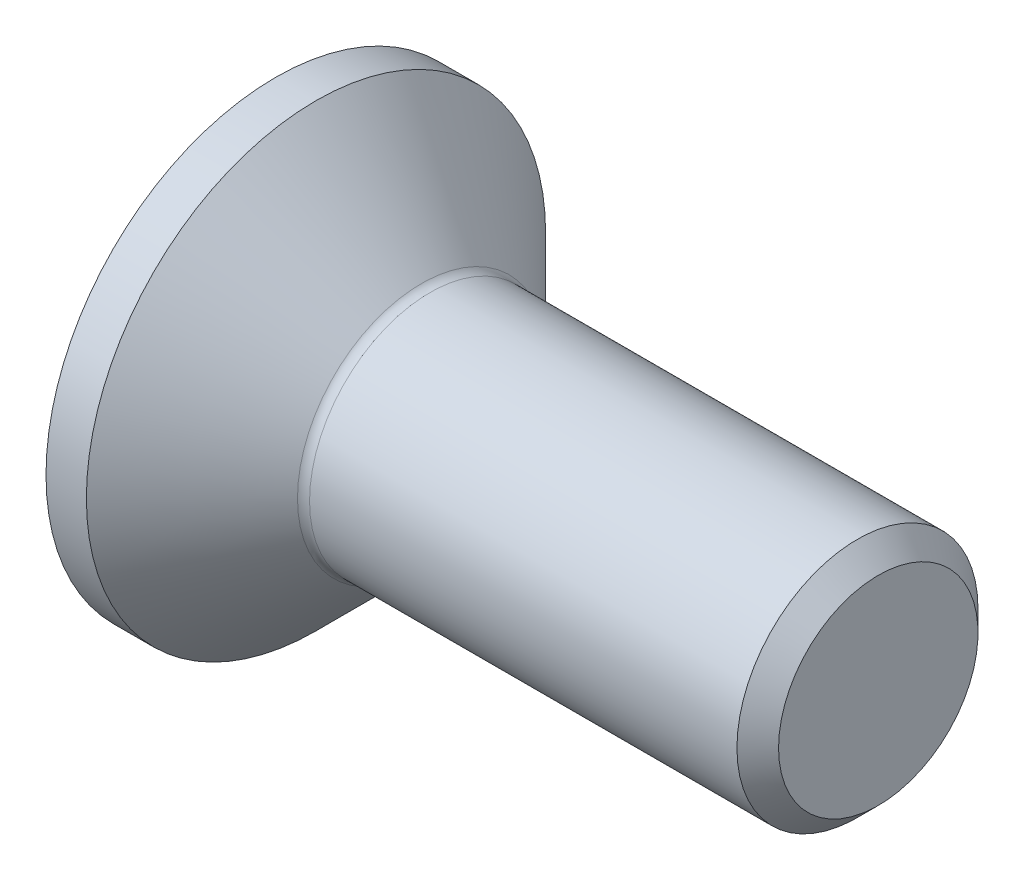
ISO-10303-21;
HEADER;
FILE_DESCRIPTION(('STEP AP214'),'2;1');
FILE_NAME('part.step','',(''),(''),'','','');
FILE_SCHEMA(('AUTOMOTIVE_DESIGN { 1 0 10303 214 1 1 1 1 }'));
ENDSEC;
DATA;
#1=APPLICATION_CONTEXT('core data for automotive mechanical design processes');
#2=APPLICATION_PROTOCOL_DEFINITION('international standard','automotive_design',2000,#1);
#3=PRODUCT_CONTEXT('',#1,'mechanical');
#4=PRODUCT('Part','Part','',(#3));
#5=PRODUCT_RELATED_PRODUCT_CATEGORY('part','',(#4));
#6=PRODUCT_DEFINITION_FORMATION('','',#4);
#7=PRODUCT_DEFINITION_CONTEXT('part definition',#1,'design');
#8=PRODUCT_DEFINITION('design','',#6,#7);
#9=PRODUCT_DEFINITION_SHAPE('','',#8);
#10=(LENGTH_UNIT() NAMED_UNIT(*) SI_UNIT(.MILLI.,.METRE.));
#11=(NAMED_UNIT(*) PLANE_ANGLE_UNIT() SI_UNIT($,.RADIAN.));
#12=(NAMED_UNIT(*) SI_UNIT($,.STERADIAN.) SOLID_ANGLE_UNIT());
#13=UNCERTAINTY_MEASURE_WITH_UNIT(LENGTH_MEASURE(1.E-05),#10,'distance_accuracy_value','');
#14=(GEOMETRIC_REPRESENTATION_CONTEXT(3) GLOBAL_UNCERTAINTY_ASSIGNED_CONTEXT((#13)) GLOBAL_UNIT_ASSIGNED_CONTEXT((#10,
#11,#12)) REPRESENTATION_CONTEXT('',''));
#15=CARTESIAN_POINT('',(0.,0.,0.));
#16=DIRECTION('',(0.,0.,1.));
#17=DIRECTION('',(1.,0.,0.));
#18=AXIS2_PLACEMENT_3D('',#15,#16,#17);
#19=CARTESIAN_POINT('',(0.,0.,0.));
#20=DIRECTION('',(-1.,0.,0.));
#21=DIRECTION('',(0.,0.,1.));
#22=AXIS2_PLACEMENT_3D('',#19,#20,#21);
#23=PLANE('',#22);
#24=CARTESIAN_POINT('',(0.,0.,0.));
#25=DIRECTION('',(-1.,0.,0.));
#26=DIRECTION('',(0.,0.,1.));
#27=AXIS2_PLACEMENT_3D('',#24,#25,#26);
#28=CIRCLE('',#27,7.62);
#29=CARTESIAN_POINT('',(0.,0.,7.62));
#30=VERTEX_POINT('',#29);
#31=EDGE_CURVE('E155',#30,#30,#28,.T.);
#32=ORIENTED_EDGE('',*,*,#31,.T.);
#33=EDGE_LOOP('',(#32));
#34=FACE_BOUND('',#33,.T.);
#35=DIRECTION('',(0.,-0.5,-0.866025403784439));
#36=VECTOR('',#35,1.);
#37=CARTESIAN_POINT('',(0.,-1.44337567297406,2.5));
#38=LINE('',#37,#36);
#39=CARTESIAN_POINT('',(0.,-1.44337567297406,2.5));
#40=VERTEX_POINT('',#39);
#41=CARTESIAN_POINT('',(0.,-2.88675134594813,0.));
#42=VERTEX_POINT('',#41);
#43=EDGE_CURVE('E117',#40,#42,#38,.T.);
#44=ORIENTED_EDGE('',*,*,#43,.T.);
#45=DIRECTION('',(0.,0.5,-0.866025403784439));
#46=VECTOR('',#45,1.);
#47=CARTESIAN_POINT('',(0.,-2.88675134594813,0.));
#48=LINE('',#47,#46);
#49=CARTESIAN_POINT('',(0.,-1.44337567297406,-2.5));
#50=VERTEX_POINT('',#49);
#51=EDGE_CURVE('E47',#42,#50,#48,.T.);
#52=ORIENTED_EDGE('',*,*,#51,.T.);
#53=DIRECTION('',(0.,1.,0.));
#54=VECTOR('',#53,1.);
#55=CARTESIAN_POINT('',(0.,-1.44337567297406,-2.5));
#56=LINE('',#55,#54);
#57=CARTESIAN_POINT('',(0.,1.44337567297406,-2.5));
#58=VERTEX_POINT('',#57);
#59=EDGE_CURVE('E132',#50,#58,#56,.T.);
#60=ORIENTED_EDGE('',*,*,#59,.T.);
#61=DIRECTION('',(0.,0.5,0.866025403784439));
#62=VECTOR('',#61,1.);
#63=CARTESIAN_POINT('',(0.,1.44337567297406,-2.5));
#64=LINE('',#63,#62);
#65=CARTESIAN_POINT('',(0.,2.88675134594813,0.));
#66=VERTEX_POINT('',#65);
#67=EDGE_CURVE('E268',#58,#66,#64,.T.);
#68=ORIENTED_EDGE('',*,*,#67,.T.);
#69=DIRECTION('',(0.,-0.5,0.866025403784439));
#70=VECTOR('',#69,1.);
#71=CARTESIAN_POINT('',(0.,2.88675134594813,0.));
#72=LINE('',#71,#70);
#73=CARTESIAN_POINT('',(0.,1.44337567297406,2.5));
#74=VERTEX_POINT('',#73);
#75=EDGE_CURVE('E271',#66,#74,#72,.T.);
#76=ORIENTED_EDGE('',*,*,#75,.T.);
#77=DIRECTION('',(0.,-1.,0.));
#78=VECTOR('',#77,1.);
#79=CARTESIAN_POINT('',(0.,1.44337567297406,2.5));
#80=LINE('',#79,#78);
#81=EDGE_CURVE('E274',#74,#40,#80,.T.);
#82=ORIENTED_EDGE('',*,*,#81,.T.);
#83=EDGE_LOOP('',(#44,#52,#60,#68,#76,#82));
#84=FACE_BOUND('',#83,.T.);
#85=ADVANCED_FACE('F32',(#34,#84),#23,.T.);
#86=CARTESIAN_POINT('',(0.,0.,0.));
#87=DIRECTION('',(-1.,0.,0.));
#88=DIRECTION('',(0.,0.,1.));
#89=AXIS2_PLACEMENT_3D('',#86,#87,#88);
#90=CYLINDRICAL_SURFACE('',#89,7.62);
#91=CARTESIAN_POINT('',(1.34000000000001,0.,0.));
#92=DIRECTION('',(-1.,0.,0.));
#93=DIRECTION('',(0.,0.,1.));
#94=AXIS2_PLACEMENT_3D('',#91,#92,#93);
#95=CIRCLE('',#94,7.62);
#96=CARTESIAN_POINT('',(1.34000000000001,0.,7.62));
#97=VERTEX_POINT('',#96);
#98=EDGE_CURVE('E152',#97,#97,#95,.T.);
#99=ORIENTED_EDGE('',*,*,#98,.T.);
#100=EDGE_LOOP('',(#99));
#101=FACE_BOUND('',#100,.T.);
#102=ORIENTED_EDGE('',*,*,#31,.F.);
#103=EDGE_LOOP('',(#102));
#104=FACE_BOUND('',#103,.T.);
#105=ADVANCED_FACE('F176',(#101,#104),#90,.T.);
#106=CARTESIAN_POINT('',(1.34000000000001,0.,0.));
#107=DIRECTION('',(-1.,0.,0.));
#108=DIRECTION('',(0.,0.,1.));
#109=AXIS2_PLACEMENT_3D('',#106,#107,#108);
#110=CONICAL_SURFACE('',#109,7.62,0.78539816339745);
#111=CARTESIAN_POINT('',(4.84284271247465,0.,0.));
#112=DIRECTION('',(-1.,0.,0.));
#113=DIRECTION('',(0.,0.,1.));
#114=AXIS2_PLACEMENT_3D('',#111,#112,#113);
#115=CIRCLE('',#114,4.11715728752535);
#116=CARTESIAN_POINT('',(4.84284271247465,0.,4.11715728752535));
#117=VERTEX_POINT('',#116);
#118=EDGE_CURVE('E40',#117,#117,#115,.T.);
#119=ORIENTED_EDGE('',*,*,#118,.T.);
#120=EDGE_LOOP('',(#119));
#121=FACE_BOUND('',#120,.T.);
#122=ORIENTED_EDGE('',*,*,#98,.F.);
#123=EDGE_LOOP('',(#122));
#124=FACE_BOUND('',#123,.T.);
#125=ADVANCED_FACE('F160',(#121,#124),#110,.T.);
#126=CARTESIAN_POINT('',(0.,0.,0.));
#127=DIRECTION('',(-1.,0.,0.));
#128=DIRECTION('',(0.,0.,1.));
#129=AXIS2_PLACEMENT_3D('',#126,#127,#128);
#130=CYLINDRICAL_SURFACE('',#129,3.99999999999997);
#131=CARTESIAN_POINT('',(5.12568542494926,0.,0.));
#132=DIRECTION('',(-1.,0.,0.));
#133=DIRECTION('',(0.,0.,1.));
#134=AXIS2_PLACEMENT_3D('',#131,#132,#133);
#135=CIRCLE('',#134,3.99999999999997);
#136=CARTESIAN_POINT('',(5.12568542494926,0.,3.99999999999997));
#137=VERTEX_POINT('',#136);
#138=EDGE_CURVE('E11',#137,#137,#135,.F.);
#139=ORIENTED_EDGE('',*,*,#138,.T.);
#140=EDGE_LOOP('',(#139));
#141=FACE_BOUND('',#140,.T.);
#142=CARTESIAN_POINT('',(19.3095,0.,0.));
#143=DIRECTION('',(-1.,0.,0.));
#144=DIRECTION('',(0.,0.,1.));
#145=AXIS2_PLACEMENT_3D('',#142,#143,#144);
#146=CIRCLE('',#145,3.99999999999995);
#147=CARTESIAN_POINT('',(19.3095,0.,3.99999999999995));
#148=VERTEX_POINT('',#147);
#149=EDGE_CURVE('E149',#148,#148,#146,.T.);
#150=ORIENTED_EDGE('',*,*,#149,.T.);
#151=EDGE_LOOP('',(#150));
#152=FACE_BOUND('',#151,.T.);
#153=ADVANCED_FACE('F187',(#141,#152),#130,.T.);
#154=CARTESIAN_POINT('',(20.,0.,0.));
#155=DIRECTION('',(-1.,0.,0.));
#156=DIRECTION('',(0.,0.,1.));
#157=AXIS2_PLACEMENT_3D('',#154,#155,#156);
#158=CONICAL_SURFACE('',#157,3.3095,0.785398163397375);
#159=ORIENTED_EDGE('',*,*,#149,.F.);
#160=EDGE_LOOP('',(#159));
#161=FACE_BOUND('',#160,.T.);
#162=CARTESIAN_POINT('',(20.,0.,0.));
#163=DIRECTION('',(-1.,0.,0.));
#164=DIRECTION('',(0.,0.,1.));
#165=AXIS2_PLACEMENT_3D('',#162,#163,#164);
#166=CIRCLE('',#165,3.3095);
#167=CARTESIAN_POINT('',(20.,0.,3.3095));
#168=VERTEX_POINT('',#167);
#169=EDGE_CURVE('E145',#168,#168,#166,.T.);
#170=ORIENTED_EDGE('',*,*,#169,.T.);
#171=EDGE_LOOP('',(#170));
#172=FACE_BOUND('',#171,.T.);
#173=ADVANCED_FACE('F171',(#161,#172),#158,.T.);
#174=CARTESIAN_POINT('',(20.,3.3095,0.));
#175=DIRECTION('',(1.,0.,0.));
#176=DIRECTION('',(0.,0.,-1.));
#177=AXIS2_PLACEMENT_3D('',#174,#175,#176);
#178=PLANE('',#177);
#179=ORIENTED_EDGE('',*,*,#169,.F.);
#180=EDGE_LOOP('',(#179));
#181=FACE_BOUND('',#180,.T.);
#182=ADVANCED_FACE('F164',(#181),#178,.T.);
#183=CARTESIAN_POINT('',(5.12568542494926,0.,0.));
#184=DIRECTION('',(-1.,0.,0.));
#185=DIRECTION('',(0.,0.,1.));
#186=AXIS2_PLACEMENT_3D('',#183,#184,#185);
#187=TOROIDAL_SURFACE('',#186,4.39999999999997,0.4);
#188=ORIENTED_EDGE('',*,*,#138,.F.);
#189=EDGE_LOOP('',(#188));
#190=FACE_BOUND('',#189,.T.);
#191=ORIENTED_EDGE('',*,*,#118,.F.);
#192=EDGE_LOOP('',(#191));
#193=FACE_BOUND('',#192,.T.);
#194=ADVANCED_FACE('F34',(#190,#193),#187,.F.);
#195=CARTESIAN_POINT('',(3.,-2.88675134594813,0.));
#196=DIRECTION('',(0.,0.866025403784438,0.5));
#197=DIRECTION('',(0.,-0.5,0.866025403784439));
#198=AXIS2_PLACEMENT_3D('',#195,#196,#197);
#199=PLANE('',#198);
#200=ORIENTED_EDGE('',*,*,#51,.F.);
#201=DIRECTION('',(-1.,0.,0.));
#202=VECTOR('',#201,1.);
#203=CARTESIAN_POINT('',(3.,-2.88675134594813,0.));
#204=LINE('',#203,#202);
#205=CARTESIAN_POINT('',(3.,-2.88675134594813,0.));
#206=VERTEX_POINT('',#205);
#207=EDGE_CURVE('E265',#206,#42,#204,.T.);
#208=ORIENTED_EDGE('',*,*,#207,.F.);
#209=DIRECTION('',(0.,0.5,-0.866025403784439));
#210=VECTOR('',#209,1.);
#211=CARTESIAN_POINT('',(3.,-2.88675134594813,0.));
#212=LINE('',#211,#210);
#213=CARTESIAN_POINT('',(3.,-2.1650635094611,-1.25));
#214=VERTEX_POINT('',#213);
#215=EDGE_CURVE('E114',#206,#214,#212,.T.);
#216=ORIENTED_EDGE('',*,*,#215,.T.);
#217=CARTESIAN_POINT('',(3.,-1.44337567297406,-2.5));
#218=VERTEX_POINT('',#217);
#219=EDGE_CURVE('E108',#214,#218,#212,.T.);
#220=ORIENTED_EDGE('',*,*,#219,.T.);
#221=DIRECTION('',(-1.,0.,0.));
#222=VECTOR('',#221,1.);
#223=CARTESIAN_POINT('',(3.,-1.44337567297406,-2.5));
#224=LINE('',#223,#222);
#225=EDGE_CURVE('E112',#218,#50,#224,.T.);
#226=ORIENTED_EDGE('',*,*,#225,.T.);
#227=EDGE_LOOP('',(#200,#208,#216,#220,#226));
#228=FACE_BOUND('',#227,.T.);
#229=ADVANCED_FACE('F110',(#228),#199,.T.);
#230=CARTESIAN_POINT('',(3.,-1.44337567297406,-2.5));
#231=DIRECTION('',(0.,0.,1.));
#232=DIRECTION('',(1.,0.,0.));
#233=AXIS2_PLACEMENT_3D('',#230,#231,#232);
#234=PLANE('',#233);
#235=ORIENTED_EDGE('',*,*,#59,.F.);
#236=ORIENTED_EDGE('',*,*,#225,.F.);
#237=DIRECTION('',(0.,1.,0.));
#238=VECTOR('',#237,1.);
#239=CARTESIAN_POINT('',(3.,-1.44337567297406,-2.5));
#240=LINE('',#239,#238);
#241=CARTESIAN_POINT('',(3.,0.,-2.5));
#242=VERTEX_POINT('',#241);
#243=EDGE_CURVE('E120',#218,#242,#240,.T.);
#244=ORIENTED_EDGE('',*,*,#243,.T.);
#245=CARTESIAN_POINT('',(3.,1.44337567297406,-2.5));
#246=VERTEX_POINT('',#245);
#247=EDGE_CURVE('E127',#242,#246,#240,.T.);
#248=ORIENTED_EDGE('',*,*,#247,.T.);
#249=DIRECTION('',(-1.,0.,0.));
#250=VECTOR('',#249,1.);
#251=CARTESIAN_POINT('',(3.,1.44337567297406,-2.5));
#252=LINE('',#251,#250);
#253=EDGE_CURVE('E134',#246,#58,#252,.T.);
#254=ORIENTED_EDGE('',*,*,#253,.T.);
#255=EDGE_LOOP('',(#235,#236,#244,#248,#254));
#256=FACE_BOUND('',#255,.T.);
#257=ADVANCED_FACE('F129',(#256),#234,.T.);
#258=CARTESIAN_POINT('',(3.,1.44337567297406,-2.5));
#259=DIRECTION('',(0.,-0.866025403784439,0.5));
#260=DIRECTION('',(0.,-0.5,-0.866025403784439));
#261=AXIS2_PLACEMENT_3D('',#258,#259,#260);
#262=PLANE('',#261);
#263=ORIENTED_EDGE('',*,*,#67,.F.);
#264=ORIENTED_EDGE('',*,*,#253,.F.);
#265=DIRECTION('',(0.,0.5,0.866025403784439));
#266=VECTOR('',#265,1.);
#267=CARTESIAN_POINT('',(3.,1.44337567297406,-2.5));
#268=LINE('',#267,#266);
#269=CARTESIAN_POINT('',(3.,2.1650635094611,-1.25));
#270=VERTEX_POINT('',#269);
#271=EDGE_CURVE('E257',#246,#270,#268,.T.);
#272=ORIENTED_EDGE('',*,*,#271,.T.);
#273=CARTESIAN_POINT('',(3.,2.88675134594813,0.));
#274=VERTEX_POINT('',#273);
#275=EDGE_CURVE('E126',#270,#274,#268,.T.);
#276=ORIENTED_EDGE('',*,*,#275,.T.);
#277=DIRECTION('',(-1.,0.,0.));
#278=VECTOR('',#277,1.);
#279=CARTESIAN_POINT('',(3.,2.88675134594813,0.));
#280=LINE('',#279,#278);
#281=EDGE_CURVE('E140',#274,#66,#280,.T.);
#282=ORIENTED_EDGE('',*,*,#281,.T.);
#283=EDGE_LOOP('',(#263,#264,#272,#276,#282));
#284=FACE_BOUND('',#283,.T.);
#285=ADVANCED_FACE('F201',(#284),#262,.T.);
#286=CARTESIAN_POINT('',(3.,2.88675134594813,0.));
#287=DIRECTION('',(0.,-0.866025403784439,-0.5));
#288=DIRECTION('',(0.,0.5,-0.866025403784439));
#289=AXIS2_PLACEMENT_3D('',#286,#287,#288);
#290=PLANE('',#289);
#291=ORIENTED_EDGE('',*,*,#75,.F.);
#292=ORIENTED_EDGE('',*,*,#281,.F.);
#293=DIRECTION('',(0.,-0.5,0.866025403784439));
#294=VECTOR('',#293,1.);
#295=CARTESIAN_POINT('',(3.,2.88675134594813,0.));
#296=LINE('',#295,#294);
#297=CARTESIAN_POINT('',(3.,2.1650635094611,1.25));
#298=VERTEX_POINT('',#297);
#299=EDGE_CURVE('E55',#274,#298,#296,.T.);
#300=ORIENTED_EDGE('',*,*,#299,.T.);
#301=CARTESIAN_POINT('',(3.,1.44337567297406,2.5));
#302=VERTEX_POINT('',#301);
#303=EDGE_CURVE('E236',#298,#302,#296,.T.);
#304=ORIENTED_EDGE('',*,*,#303,.T.);
#305=DIRECTION('',(-1.,0.,0.));
#306=VECTOR('',#305,1.);
#307=CARTESIAN_POINT('',(3.,1.44337567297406,2.5));
#308=LINE('',#307,#306);
#309=EDGE_CURVE('E250',#302,#74,#308,.T.);
#310=ORIENTED_EDGE('',*,*,#309,.T.);
#311=EDGE_LOOP('',(#291,#292,#300,#304,#310));
#312=FACE_BOUND('',#311,.T.);
#313=ADVANCED_FACE('F204',(#312),#290,.T.);
#314=CARTESIAN_POINT('',(3.,1.44337567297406,2.5));
#315=DIRECTION('',(0.,0.,-1.));
#316=DIRECTION('',(-1.,0.,0.));
#317=AXIS2_PLACEMENT_3D('',#314,#315,#316);
#318=PLANE('',#317);
#319=ORIENTED_EDGE('',*,*,#81,.F.);
#320=ORIENTED_EDGE('',*,*,#309,.F.);
#321=DIRECTION('',(0.,-1.,0.));
#322=VECTOR('',#321,1.);
#323=CARTESIAN_POINT('',(3.,1.44337567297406,2.5));
#324=LINE('',#323,#322);
#325=CARTESIAN_POINT('',(3.,0.,2.5));
#326=VERTEX_POINT('',#325);
#327=EDGE_CURVE('E235',#302,#326,#324,.T.);
#328=ORIENTED_EDGE('',*,*,#327,.T.);
#329=CARTESIAN_POINT('',(3.,-1.44337567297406,2.5));
#330=VERTEX_POINT('',#329);
#331=EDGE_CURVE('E241',#326,#330,#324,.T.);
#332=ORIENTED_EDGE('',*,*,#331,.T.);
#333=DIRECTION('',(-1.,0.,0.));
#334=VECTOR('',#333,1.);
#335=CARTESIAN_POINT('',(3.,-1.44337567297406,2.5));
#336=LINE('',#335,#334);
#337=EDGE_CURVE('E280',#330,#40,#336,.T.);
#338=ORIENTED_EDGE('',*,*,#337,.T.);
#339=EDGE_LOOP('',(#319,#320,#328,#332,#338));
#340=FACE_BOUND('',#339,.T.);
#341=ADVANCED_FACE('F208',(#340),#318,.T.);
#342=CARTESIAN_POINT('',(3.,-1.44337567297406,2.5));
#343=DIRECTION('',(0.,0.866025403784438,-0.5));
#344=DIRECTION('',(0.,0.5,0.866025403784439));
#345=AXIS2_PLACEMENT_3D('',#342,#343,#344);
#346=PLANE('',#345);
#347=ORIENTED_EDGE('',*,*,#43,.F.);
#348=ORIENTED_EDGE('',*,*,#337,.F.);
#349=DIRECTION('',(0.,-0.5,-0.866025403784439));
#350=VECTOR('',#349,1.);
#351=CARTESIAN_POINT('',(3.,-1.44337567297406,2.5));
#352=LINE('',#351,#350);
#353=CARTESIAN_POINT('',(3.,-2.1650635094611,1.25));
#354=VERTEX_POINT('',#353);
#355=EDGE_CURVE('E244',#330,#354,#352,.T.);
#356=ORIENTED_EDGE('',*,*,#355,.T.);
#357=EDGE_CURVE('E251',#354,#206,#352,.T.);
#358=ORIENTED_EDGE('',*,*,#357,.T.);
#359=ORIENTED_EDGE('',*,*,#207,.T.);
#360=EDGE_LOOP('',(#347,#348,#356,#358,#359));
#361=FACE_BOUND('',#360,.T.);
#362=ADVANCED_FACE('F211',(#361),#346,.T.);
#363=CARTESIAN_POINT('',(3.,-2.88675134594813,0.));
#364=DIRECTION('',(-1.,0.,0.));
#365=DIRECTION('',(0.,0.,1.));
#366=AXIS2_PLACEMENT_3D('',#363,#364,#365);
#367=PLANE('',#366);
#368=CARTESIAN_POINT('',(3.,0.,0.));
#369=DIRECTION('',(-1.,0.,0.));
#370=DIRECTION('',(0.,0.,1.));
#371=AXIS2_PLACEMENT_3D('',#368,#369,#370);
#372=CIRCLE('',#371,2.5);
#373=EDGE_CURVE('E133',#354,#326,#372,.T.);
#374=ORIENTED_EDGE('',*,*,#373,.F.);
#375=ORIENTED_EDGE('',*,*,#355,.F.);
#376=ORIENTED_EDGE('',*,*,#331,.F.);
#377=EDGE_LOOP('',(#374,#375,#376));
#378=FACE_BOUND('',#377,.T.);
#379=ADVANCED_FACE('F215',(#378),#367,.T.);
#380=EDGE_CURVE('E137',#214,#354,#372,.T.);
#381=ORIENTED_EDGE('',*,*,#380,.F.);
#382=ORIENTED_EDGE('',*,*,#215,.F.);
#383=ORIENTED_EDGE('',*,*,#357,.F.);
#384=EDGE_LOOP('',(#381,#382,#383));
#385=FACE_BOUND('',#384,.T.);
#386=ADVANCED_FACE('F218',(#385),#367,.T.);
#387=EDGE_CURVE('E122',#242,#214,#372,.T.);
#388=ORIENTED_EDGE('',*,*,#387,.F.);
#389=ORIENTED_EDGE('',*,*,#243,.F.);
#390=ORIENTED_EDGE('',*,*,#219,.F.);
#391=EDGE_LOOP('',(#388,#389,#390));
#392=FACE_BOUND('',#391,.T.);
#393=ADVANCED_FACE('F121',(#392),#367,.T.);
#394=EDGE_CURVE('E253',#270,#242,#372,.T.);
#395=ORIENTED_EDGE('',*,*,#394,.F.);
#396=ORIENTED_EDGE('',*,*,#271,.F.);
#397=ORIENTED_EDGE('',*,*,#247,.F.);
#398=EDGE_LOOP('',(#395,#396,#397));
#399=FACE_BOUND('',#398,.T.);
#400=ADVANCED_FACE('F230',(#399),#367,.T.);
#401=EDGE_CURVE('E146',#298,#270,#372,.T.);
#402=ORIENTED_EDGE('',*,*,#401,.F.);
#403=ORIENTED_EDGE('',*,*,#299,.F.);
#404=ORIENTED_EDGE('',*,*,#275,.F.);
#405=EDGE_LOOP('',(#402,#403,#404));
#406=FACE_BOUND('',#405,.T.);
#407=ADVANCED_FACE('F225',(#406),#367,.T.);
#408=EDGE_CURVE('E139',#326,#298,#372,.T.);
#409=ORIENTED_EDGE('',*,*,#408,.F.);
#410=ORIENTED_EDGE('',*,*,#327,.F.);
#411=ORIENTED_EDGE('',*,*,#303,.F.);
#412=EDGE_LOOP('',(#409,#410,#411));
#413=FACE_BOUND('',#412,.T.);
#414=ADVANCED_FACE('F196',(#413),#367,.T.);
#415=CARTESIAN_POINT('',(3.,0.,0.));
#416=DIRECTION('',(-1.,0.,0.));
#417=DIRECTION('',(0.,0.,1.));
#418=AXIS2_PLACEMENT_3D('',#415,#416,#417);
#419=CONICAL_SURFACE('',#418,2.5,1.04719755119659);
#420=CARTESIAN_POINT('',(4.44337567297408,0.,0.));
#421=VERTEX_POINT('',#420);
#422=VERTEX_LOOP('',#421);
#423=FACE_BOUND('',#422,.T.);
#424=ORIENTED_EDGE('',*,*,#408,.T.);
#425=ORIENTED_EDGE('',*,*,#401,.T.);
#426=ORIENTED_EDGE('',*,*,#394,.T.);
#427=ORIENTED_EDGE('',*,*,#387,.T.);
#428=ORIENTED_EDGE('',*,*,#380,.T.);
#429=ORIENTED_EDGE('',*,*,#373,.T.);
#430=EDGE_LOOP('',(#424,#425,#426,#427,#428,#429));
#431=FACE_BOUND('',#430,.T.);
#432=ADVANCED_FACE('F194',(#423,#431),#419,.F.);
#433=CLOSED_SHELL('',(#85,#105,#125,#153,#173,#182,#194,#229,#257,#285,#313,#341,#362,#379,#386,
#393,#400,#407,#414,#432));
#434=MANIFOLD_SOLID_BREP('B2',#433);
#435=ADVANCED_BREP_SHAPE_REPRESENTATION('',(#18,#434),#14);
#436=SHAPE_DEFINITION_REPRESENTATION(#9,#435);
ENDSEC;
END-ISO-10303-21;
